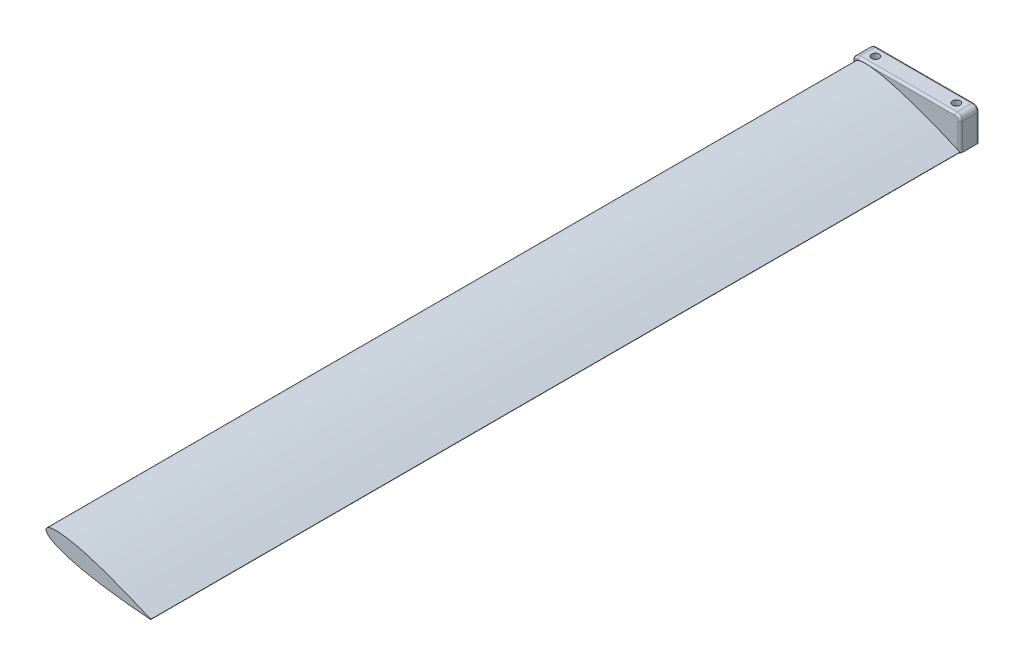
from build123d import *

# Parameters (mm, degrees)
SKETCH2_W           = 50.8
SKETCH2_H           = 15.24
BOSS_EXTRUDE2_DEPTH = 8.89
SKETCH3_R           = 1.7907
CUT_EXTRUDE1_DEPTH  = 53.578613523
FILLET1_R           = 2.54
FILLET2_R           = 1.016
SKETCH10_R          = 2
CUT_EXTRUDE2_DEPTH  = 40


with BuildPart() as part:
    # Sketch2 → Boss-Extrude2 (new body)
    with BuildSketch(Plane.XY):
        with Locations((24.13, -5.08)):
            Rectangle(SKETCH2_W, SKETCH2_H)
    extrude(amount=-BOSS_EXTRUDE2_DEPTH)

    # Sketch3 → Cut-Extrude1 (cut, through all)
    with BuildSketch(Plane(origin=(0, 2.54, 0), x_dir=(1, 0, 0), z_dir=(0, 1, 0))):
        with Locations(Location((43.18, 4.445, 0), (0, 0, 270))):
            Circle(SKETCH3_R)
        with Locations(Location((5.08, 4.445, 0), (0, 0, 270))):
            Circle(SKETCH3_R)
    extrude(amount=-CUT_EXTRUDE1_DEPTH, mode=Mode.SUBTRACT)

    # Fillet1
    fillet1_edges = [part.edges().sort_by_distance(p)[0] for p in [
        (-1.27, 2.54, -4.445),
        (49.53, 2.54, -4.445),
    ]]
    fillet(fillet1_edges, radius=FILLET1_R)

    # Fillet2
    fillet2_edges = [part.edges().sort_by_distance(p)[0] for p in [
        (49.53, -6.35, 0),
        (49.53, -6.35, -8.89),
        (-1.27, -6.35, 0),
        (24.13, 2.54, 0),
        (-0.526051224, 1.796051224, 0),
        (48.786051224, 1.796051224, 0),
        (24.13, 2.54, -8.89),
        (-1.27, -6.35, -8.89),
        (-0.526051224, 1.796051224, -8.89),
        (48.786051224, 1.796051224, -8.89),
    ]]
    fillet(fillet2_edges, radius=FILLET2_R)


with BuildPart() as body_2:
    # Sketch8 for Loft12 → Loft12 section 0
    with BuildSketch(Plane.XY.offset(381)):
        with BuildLine():
            # circular arc as an exact rational Bezier (weights 1, cos(half-angle), 1)
            Bezier((49.306829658, -12.218855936), (49.303363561, -12.300713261), (49.267993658, -12.374615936), weights=[1, 0.979660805, 1])
            add(Edge.make_bspline(
                [(49.306829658, -12.218855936), (48.520811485, -11.872808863), (46.949987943, -11.181248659), (43.79649452, -9.837440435), (39.840972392, -8.21114305), (35.071528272, -6.340065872), (30.281343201, -4.554213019), (25.465738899, -2.870081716), (20.616489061, -1.317567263), (16.533268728, -0.178601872), (13.234161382, 0.596336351), (10.73645361, 1.089574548), (8.207266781, 1.470959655), (6.068448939, 1.65532264), (4.328346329, 1.674303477), (2.983423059, 1.593593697), (1.816333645, 1.379640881), (0.718249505, 0.985265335), (-0.287094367, 0.063576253), (0.167864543, -1.222207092), (0.952267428, -2.085939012), (1.882301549, -2.822763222), (3.031907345, -3.525429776), (4.577237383, -4.32559988), (6.5522548, -5.166930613), (8.964443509, -6.017568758), (11.401350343, -6.754667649), (14.678100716, -7.619274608), (18.818081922, -8.530584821), (23.828576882, -9.436380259), (28.871155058, -10.210168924), (33.939044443, -10.882211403), (39.028631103, -11.469264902), (43.28464986, -11.890337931), (46.69989903, -12.184298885), (48.411521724, -12.311144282), (49.267993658, -12.374615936)],
                knots=[0, 0, 0, 0, 0.024684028, 0.04932997, 0.098522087, 0.147602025, 0.196578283, 0.245450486, 0.294218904, 0.342903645, 0.367241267, 0.391607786, 0.416059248, 0.440726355, 0.453242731, 0.466028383, 0.479472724, 0.486972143, 0.500000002, 0.513027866, 0.520527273, 0.53397162, 0.546757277, 0.559273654, 0.583940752, 0.608392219, 0.632758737, 0.657096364, 0.705781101, 0.754549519, 0.803421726, 0.852397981, 0.901477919, 0.950670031, 0.975315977, 1, 1, 1, 1], degree=3))
        make_face()
    # Sketch11 for Loft12 → Loft12 section 1
    with BuildSketch(Plane.XY):
        with BuildLine():
            Bezier((49.271605, -12.367512), (49.368903, -12.30905), (49.310441, -12.211752), weights=[1, 0.707106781, 1])
            add(Edge.make_bspline(
                [(49.310441, -12.211752), (48.524422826, -11.865704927), (46.953599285, -11.174144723), (43.800105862, -9.830336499), (39.844583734, -8.204039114), (35.075139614, -6.332961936), (30.284954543, -4.547109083), (25.46935024, -2.86297778), (20.620100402, -1.310463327), (16.53688007, -0.171497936), (13.237772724, 0.603440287), (10.740064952, 1.096678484), (8.210878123, 1.478063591), (6.072060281, 1.662426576), (4.33195767, 1.681407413), (2.987034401, 1.600697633), (1.819944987, 1.386744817), (0.721860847, 0.992369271), (-0.283483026, 0.070680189), (0.171475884, -1.215103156), (0.955878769, -2.078835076), (1.88591289, -2.815659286), (3.035518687, -3.51832584), (4.580848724, -4.318495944), (6.555866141, -5.159826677), (8.968054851, -6.010464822), (11.404961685, -6.747563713), (14.681712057, -7.612170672), (18.821693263, -8.523480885), (23.832188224, -9.429276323), (28.874766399, -10.203064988), (33.942655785, -10.875107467), (39.032242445, -11.462160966), (43.288261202, -11.883233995), (46.703510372, -12.177194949), (48.415133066, -12.304040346), (49.271605, -12.367512)],
                knots=[0, 0, 0, 0, 0.024684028, 0.04932997, 0.098522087, 0.147602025, 0.196578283, 0.245450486, 0.294218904, 0.342903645, 0.367241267, 0.391607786, 0.416059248, 0.440726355, 0.453242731, 0.466028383, 0.479472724, 0.486972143, 0.500000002, 0.513027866, 0.520527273, 0.53397162, 0.546757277, 0.559273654, 0.583940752, 0.608392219, 0.632758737, 0.657096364, 0.705781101, 0.754549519, 0.803421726, 0.852397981, 0.901477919, 0.950670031, 0.975315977, 1, 1, 1, 1], degree=3))
        make_face()
    loft()


with BuildPart() as cut_extrude2_tool:
    # Sketch10 → Cut-Extrude2 (new body)
    with BuildSketch(Plane(origin=(0, 0, -8.89), x_dir=(-1, 0, 0), z_dir=(0, 0, -1))):
        with Locations((-11.090480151, -2.765167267)):
            Circle(SKETCH10_R)
        with Locations((-19.716409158, -4.915852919)):
            Circle(SKETCH10_R)
        with Locations((-28.342338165, -7.06653857)):
            Circle(SKETCH10_R)
    extrude(amount=-CUT_EXTRUDE2_DEPTH)


with BuildPart() as part_1:
    add(part.part)

    # Cut-Extrude2: cut by cut_extrude2_tool
    add(cut_extrude2_tool.part, mode=Mode.SUBTRACT)


with BuildPart() as body_2_1:
    add(body_2.part)

    # Cut-Extrude2: cut by cut_extrude2_tool
    add(cut_extrude2_tool.part, mode=Mode.SUBTRACT)


solid = Compound([part_1.part, body_2_1.part])
